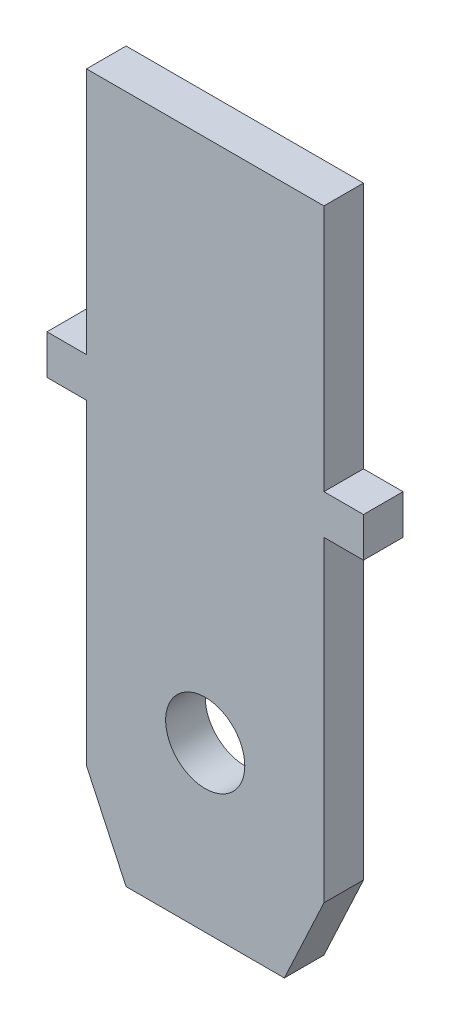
from build123d import *

# Parameters (mm, degrees)
ESQUISSE1_R        = 1
BOSS_EXTRU_1_DEPTH = 1


with BuildPart() as part:
    # Esquisse1 → Boss.-Extru.1 (new body)
    with BuildSketch(Plane.XY):
        Polygon((0, 0), (0, 1), (1, 1), (1, 7.254701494), (7, 7.254701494), (7, 1), (8, 1), (8, 0), (7, 0), (7, -8), (6, -10.144506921), (2, -10.144506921), (1, -8), (1, 0), align=None)
        with Locations((4, -6)):
            Circle(ESQUISSE1_R, mode=Mode.SUBTRACT)
    extrude(amount=BOSS_EXTRU_1_DEPTH)


solid = part.part
